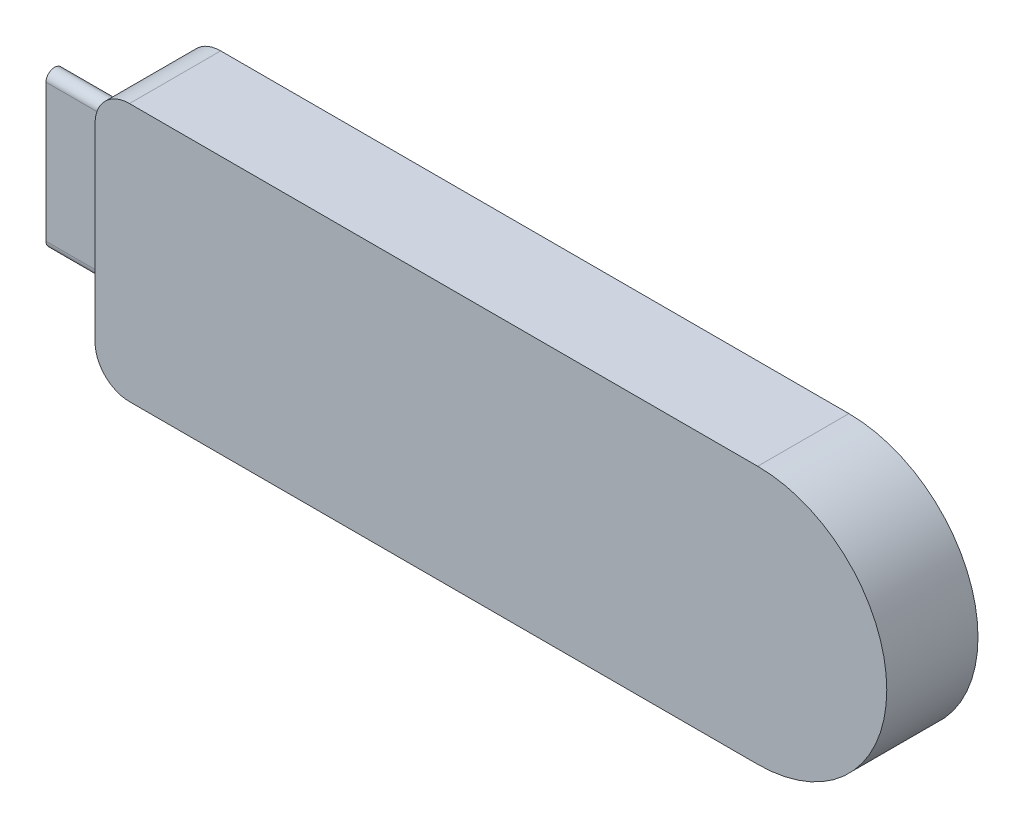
from build123d import *

# Parameters (mm, degrees)
BOSS_EXTRU_1_DEPTH = 5.3
BOSS_EXTRU_2_DEPTH = 5
CONG_1_R           = 2


with BuildPart() as part:
    # Esquisse1 → Boss.-Extru.1 (new body)
    with BuildSketch(Plane.XY):
        with BuildLine():
            Line((0, 7.5), (38.5, 7.5))
            ThreePointArc((38.5, 7.5), (46, 0), (38.5, -7.5))
            Line((38.5, -7.5), (0, -7.5))
            Line((0, -7.5), (0, 7.5))
        make_face()
    extrude(amount=BOSS_EXTRU_1_DEPTH)

    # Cong_1
    cong_1_edges = [part.edges().sort_by_distance(p)[0] for p in [
        (0, 7.5, 2.65),
        (0, -7.5, 2.65),
    ]]
    fillet(cong_1_edges, radius=CONG_1_R)


with BuildPart() as body_2:
    # Esquisse3 → R_volution1 (revolve)
    with BuildSketch(Plane(origin=(0, 0, 0), x_dir=(1, 0, 0), z_dir=(0, 1, 0)), mode=Mode.PRIVATE) as r_volution1_sk:
        with BuildLine():
            Line((28, 0), (28, 3.8))
            ThreePointArc((28, 3.8), (26.939339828, 3.360660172), (26.5, 2.3))
            Line((26.5, 2.3), (26.5, 0))
            Line((26.5, 0), (28, 0))
        make_face()
    revolve(r_volution1_sk.sketch.rotate(Axis((28, 0, 0), (0, 0, -1)), 180), axis=Axis((28, 0, 0), (0, 0, -1)))


with BuildPart() as body_3:
    # Esquisse4 → Boss.-Extru.2 (new body)
    with BuildSketch(Plane.ZY):
        with BuildLine():
            Line((2.15, -4), (2.15, 4))
            ThreePointArc((2.15, 4), (2.65, 4.5), (3.15, 4))
            Line((3.15, 4), (3.15, -4))
            ThreePointArc((3.15, -4), (2.65, -4.5), (2.15, -4))
        make_face()
    extrude(amount=BOSS_EXTRU_2_DEPTH)


solid = Compound([part.part, body_2.part, body_3.part])
